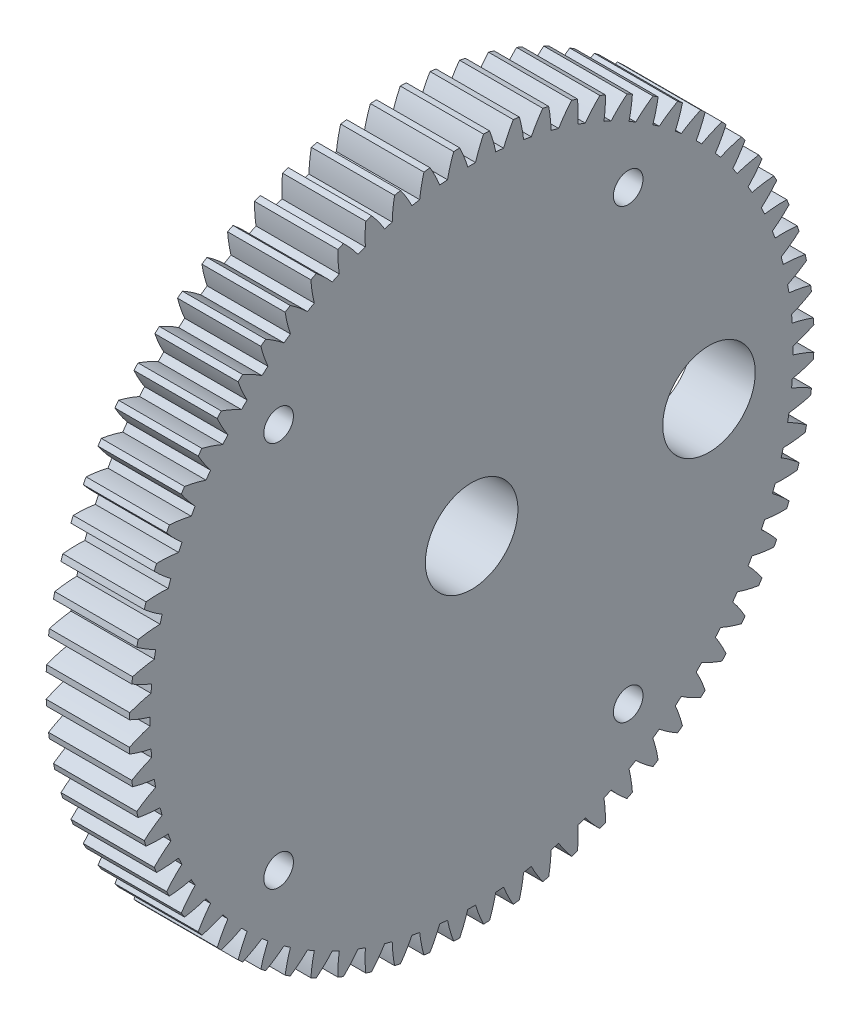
from build123d import *

# Parameters (mm, degrees)
BASPROSKE_W                                         = 9
BASPROSKE_H                                         = 37
TOOTHCUT_DEPTH                                      = 54.09425581
TEETHCUTS_COUNT                                     = 72
TEETHCUTS_ANGLE                                     = 355
HUBNEAONESKE_R                                      = 10.5
HUBNEARONE_DEPTH                                    = 9.0000508
BORSKE_R                                            = 5
BORE_DEPTH                                          = 18.0000508
CUT_EXTRUDE1_START                                  = -2.2
SKETCH1_R                                           = 33
SKETCH1_R_2                                         = 10.5
CUT_EXTRUDE1_DEPTH                                  = 2.2
SKETCH2_R                                           = 5
CUT_EXTRUDE3_DEPTH                                  = 54.480185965
CUT_EXTRUDE4_DEPTH                                  = 54.063076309
CUT_EXTRUDE4_DEPTH_BACK                             = 54.063076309
SKETCH3_W                                           = 9.0000508
SKETCH3_H                                           = 21
CUT_EXTRUDE5_REACH                                  = 54.735
SKETCH4_R                                           = 1.6
CSK_FOR_M3_COUNTERSUNK_FLAT_HEAD_SCREW1_D           = 3.2
CSK_FOR_M3_COUNTERSUNK_FLAT_HEAD_SCREW1_CSINK_D     = 6.3
CSK_FOR_M3_COUNTERSUNK_FLAT_HEAD_SCREW1_CSINK_ANGLE = 90


with BuildPart() as part:
    # BasProSke → Base-Revolve (revolve)
    with BuildSketch(Plane(origin=(0, 0, 0), x_dir=(1, 0, 0), z_dir=(0, 1, 0)), mode=Mode.PRIVATE) as base_revolve_sk:
        with Locations((4.5, 18.5)):
            Rectangle(BASPROSKE_W, BASPROSKE_H)
    revolve(base_revolve_sk.sketch.rotate(Axis((-10, 0, 0), (1, 0, 0)), 180), axis=Axis((-10, 0, 0), (1, 0, 0)))

    # TooCutSke → ToothCut (cut, through all)
    with BuildSketch(Plane(origin=(0, 0, 0), x_dir=(0, 0, -1), z_dir=(1, 0, 0))):
        with BuildLine():
            ThreePointArc((0.423780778, 34.746415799), (0, 34.749), (-0.423780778, 34.746415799))
            ThreePointArc((-0.423780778, 34.746415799), (-0.813812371, 35.892927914), (-1.298800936, 37.002612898))
            ThreePointArc((-1.298800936, 37.002612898), (0, 37.0254), (1.298800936, 37.002612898))
            ThreePointArc((1.298800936, 37.002612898), (0.813812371, 35.892927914), (0.423780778, 34.746415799))
        make_face()
    toothcut = extrude(amount=TOOTHCUT_DEPTH, mode=Mode.SUBTRACT)

    # TeethCuts: ToothCut ×72 about axis
    teethcuts_axis = Axis((-10, 0, 0), (1, 0, 0))
    for i in range(1, TEETHCUTS_COUNT):
        add(toothcut.rotate(teethcuts_axis, i * TEETHCUTS_ANGLE / (TEETHCUTS_COUNT - 1)), mode=Mode.SUBTRACT)

    # HubNeaOneSke → HubNearOne (add)
    with BuildSketch(Plane.ZY):
        with Locations(Location((0, 0, 0), (0, 0, 180))):
            Circle(HUBNEAONESKE_R)
    extrude(amount=HUBNEARONE_DEPTH)

    # BorSke → Bore (cut, symmetric)
    with BuildSketch(Plane(origin=(0, 0, 0), x_dir=(0, 0, -1), z_dir=(1, 0, 0))):
        with Locations(Location((0, 0, 0), (0, 0, 180))):
            Circle(BORSKE_R)
    extrude(amount=BORE_DEPTH, both=True, mode=Mode.SUBTRACT)

    # Sketch1 → Cut-Extrude1 (cut)
    with BuildSketch(Plane.ZY.offset(CUT_EXTRUDE1_START)):
        Circle(SKETCH1_R)
        with Locations(Location((0, 0, 0), (0, 0, 180))):
            Circle(SKETCH1_R_2, mode=Mode.SUBTRACT)
    extrude(amount=CUT_EXTRUDE1_DEPTH, mode=Mode.SUBTRACT)

    # Sketch2 → Cut-Extrude3 (cut, through all)
    with BuildSketch(Plane.ZY.offset(-2.2)):
        with Locations((-25.655, 0)):
            Circle(SKETCH2_R)
        Circle(SKETCH2_R)
    extrude(amount=-CUT_EXTRUDE3_DEPTH, mode=Mode.SUBTRACT)

    # Sketch3 → Cut-Extrude4 (cut, two sides: drawn at the far end of the back side and taken through both)
    with BuildSketch(Plane.XY.offset(-CUT_EXTRUDE4_DEPTH_BACK)):
        with Locations((-4.5000254, 0)):
            Rectangle(SKETCH3_W, SKETCH3_H)
    extrude(amount=CUT_EXTRUDE4_DEPTH + CUT_EXTRUDE4_DEPTH_BACK, mode=Mode.SUBTRACT)

    # Sketch4 → Cut-Extrude5 (cut, up to next)
    with BuildSketch(Plane.ZY.offset(-2.2), mode=Mode.PRIVATE) as cut_extrude5_sk1:
        with Locations((20.859650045, 20.859650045)):
            Circle(SKETCH4_R)
    cut_extrude5_tool1 = extrude(cut_extrude5_sk1.sketch, amount=-CUT_EXTRUDE5_REACH, mode=Mode.PRIVATE) & part.part
    # Sketch4 → Cut-Extrude5 (cut, up to next)
    with BuildSketch(Plane.ZY.offset(-2.2), mode=Mode.PRIVATE) as cut_extrude5_sk2:
        with Locations((20.859650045, -20.859650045)):
            Circle(SKETCH4_R)
    cut_extrude5_tool2 = extrude(cut_extrude5_sk2.sketch, amount=-CUT_EXTRUDE5_REACH, mode=Mode.PRIVATE) & part.part
    # Sketch4 → Cut-Extrude5 (cut, up to next)
    with BuildSketch(Plane.ZY.offset(-2.2), mode=Mode.PRIVATE) as cut_extrude5_sk3:
        with Locations((-16.920504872, 24.164985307)):
            Circle(SKETCH4_R)
    cut_extrude5_tool3 = extrude(cut_extrude5_sk3.sketch, amount=-CUT_EXTRUDE5_REACH, mode=Mode.PRIVATE) & part.part
    # Sketch4 → Cut-Extrude5 (cut, up to next)
    with BuildSketch(Plane.ZY.offset(-2.2), mode=Mode.PRIVATE) as cut_extrude5_sk4:
        with Locations((-16.920504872, -24.164985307)):
            Circle(SKETCH4_R)
    cut_extrude5_tool4 = extrude(cut_extrude5_sk4.sketch, amount=-CUT_EXTRUDE5_REACH, mode=Mode.PRIVATE) & part.part
    add(cut_extrude5_tool1.solids().sort_by_distance((2.2, 20.85965, 20.85965))[0], mode=Mode.SUBTRACT)
    add(cut_extrude5_tool2.solids().sort_by_distance((2.2, -20.85965, 20.85965))[0], mode=Mode.SUBTRACT)
    add(cut_extrude5_tool3.solids().sort_by_distance((2.2, 24.164985, -16.920505))[0], mode=Mode.SUBTRACT)
    add(cut_extrude5_tool4.solids().sort_by_distance((2.2, -24.164985, -16.920505))[0], mode=Mode.SUBTRACT)

    # CSK for M3 Countersunk Flat Head Screw1 (through all)
    with Locations(Plane.ZY.offset(-2.2)):
        with Locations((20.859650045, 20.859650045), (20.859650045, -20.859650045), (-16.920504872, 24.164985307), (-16.920504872, -24.164985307)):
            CounterSinkHole(CSK_FOR_M3_COUNTERSUNK_FLAT_HEAD_SCREW1_D / 2, CSK_FOR_M3_COUNTERSUNK_FLAT_HEAD_SCREW1_CSINK_D / 2, counter_sink_angle=CSK_FOR_M3_COUNTERSUNK_FLAT_HEAD_SCREW1_CSINK_ANGLE)


solid = part.part
